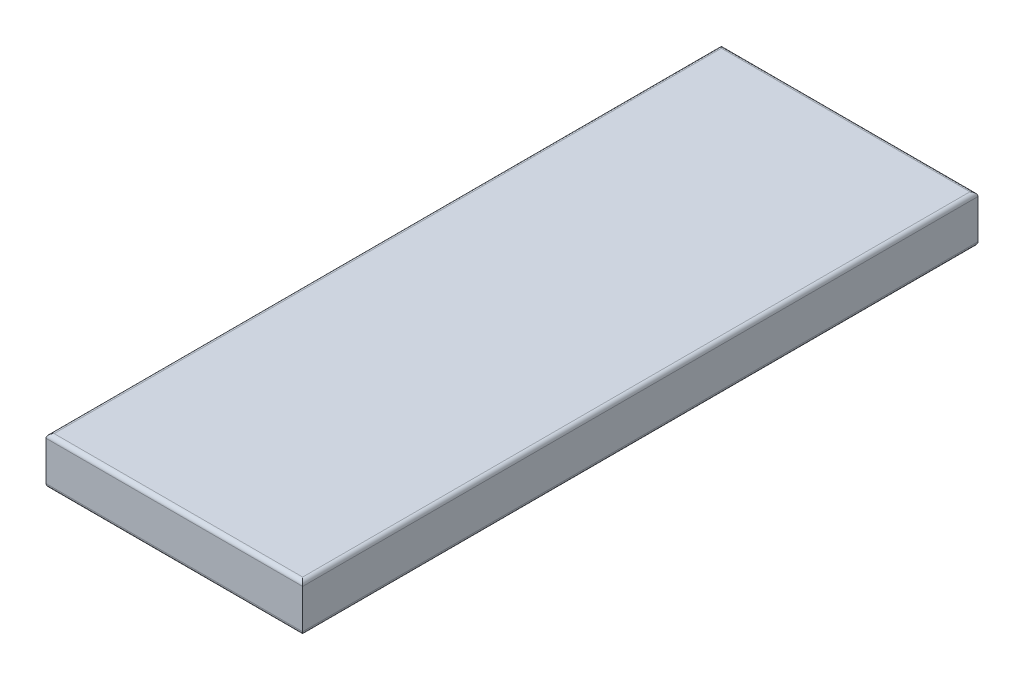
ISO-10303-21;
HEADER;
FILE_DESCRIPTION(('STEP AP214'),'2;1');
FILE_NAME('part.step','',(''),(''),'','','');
FILE_SCHEMA(('AUTOMOTIVE_DESIGN { 1 0 10303 214 1 1 1 1 }'));
ENDSEC;
DATA;
#1=APPLICATION_CONTEXT('core data for automotive mechanical design processes');
#2=APPLICATION_PROTOCOL_DEFINITION('international standard','automotive_design',2000,#1);
#3=PRODUCT_CONTEXT('',#1,'mechanical');
#4=PRODUCT('Part','Part','',(#3));
#5=PRODUCT_RELATED_PRODUCT_CATEGORY('part','',(#4));
#6=PRODUCT_DEFINITION_FORMATION('','',#4);
#7=PRODUCT_DEFINITION_CONTEXT('part definition',#1,'design');
#8=PRODUCT_DEFINITION('design','',#6,#7);
#9=PRODUCT_DEFINITION_SHAPE('','',#8);
#10=(LENGTH_UNIT() NAMED_UNIT(*) SI_UNIT(.MILLI.,.METRE.));
#11=(NAMED_UNIT(*) PLANE_ANGLE_UNIT() SI_UNIT($,.RADIAN.));
#12=(NAMED_UNIT(*) SI_UNIT($,.STERADIAN.) SOLID_ANGLE_UNIT());
#13=UNCERTAINTY_MEASURE_WITH_UNIT(LENGTH_MEASURE(1.E-05),#10,'distance_accuracy_value','');
#14=(GEOMETRIC_REPRESENTATION_CONTEXT(3) GLOBAL_UNCERTAINTY_ASSIGNED_CONTEXT((#13)) GLOBAL_UNIT_ASSIGNED_CONTEXT((#10,
#11,#12)) REPRESENTATION_CONTEXT('',''));
#15=CARTESIAN_POINT('',(0.,0.,0.));
#16=DIRECTION('',(0.,0.,1.));
#17=DIRECTION('',(1.,0.,0.));
#18=AXIS2_PLACEMENT_3D('',#15,#16,#17);
#19=CARTESIAN_POINT('',(9.5,1.75,50.));
#20=DIRECTION('',(-1.,0.,0.));
#21=DIRECTION('',(0.,0.,1.));
#22=AXIS2_PLACEMENT_3D('',#19,#20,#21);
#23=PLANE('',#22);
#24=DIRECTION('',(0.,1.,0.));
#25=VECTOR('',#24,1.);
#26=CARTESIAN_POINT('',(9.5,1.75,50.));
#27=LINE('',#26,#25);
#28=CARTESIAN_POINT('',(9.5,-1.45,50.));
#29=VERTEX_POINT('',#28);
#30=CARTESIAN_POINT('',(9.5,1.45,50.));
#31=VERTEX_POINT('',#30);
#32=EDGE_CURVE('E180',#29,#31,#27,.T.);
#33=ORIENTED_EDGE('',*,*,#32,.F.);
#34=DIRECTION('',(0.,0.,-1.));
#35=VECTOR('',#34,1.);
#36=CARTESIAN_POINT('',(9.5,-1.45,50.));
#37=LINE('',#36,#35);
#38=CARTESIAN_POINT('',(9.5,-1.45,0.));
#39=VERTEX_POINT('',#38);
#40=EDGE_CURVE('E138',#29,#39,#37,.T.);
#41=ORIENTED_EDGE('',*,*,#40,.T.);
#42=DIRECTION('',(0.,1.,0.));
#43=VECTOR('',#42,1.);
#44=CARTESIAN_POINT('',(9.5,1.75,0.));
#45=LINE('',#44,#43);
#46=CARTESIAN_POINT('',(9.5,1.45,0.));
#47=VERTEX_POINT('',#46);
#48=EDGE_CURVE('E153',#39,#47,#45,.T.);
#49=ORIENTED_EDGE('',*,*,#48,.T.);
#50=DIRECTION('',(0.,0.,-1.));
#51=VECTOR('',#50,1.);
#52=CARTESIAN_POINT('',(9.5,1.45,50.));
#53=LINE('',#52,#51);
#54=EDGE_CURVE('E135',#47,#31,#53,.F.);
#55=ORIENTED_EDGE('',*,*,#54,.T.);
#56=EDGE_LOOP('',(#33,#41,#49,#55));
#57=FACE_BOUND('',#56,.T.);
#58=ADVANCED_FACE('F33',(#57),#23,.F.);
#59=CARTESIAN_POINT('',(-9.5,1.75,50.));
#60=DIRECTION('',(0.,-1.,0.));
#61=DIRECTION('',(0.,0.,-1.));
#62=AXIS2_PLACEMENT_3D('',#59,#60,#61);
#63=PLANE('',#62);
#64=DIRECTION('',(-1.,0.,0.));
#65=VECTOR('',#64,1.);
#66=CARTESIAN_POINT('',(9.5,1.75,49.7));
#67=LINE('',#66,#65);
#68=CARTESIAN_POINT('',(-9.2,1.75,49.7));
#69=VERTEX_POINT('',#68);
#70=CARTESIAN_POINT('',(9.2,1.75,49.7));
#71=VERTEX_POINT('',#70);
#72=EDGE_CURVE('E42',#69,#71,#67,.F.);
#73=ORIENTED_EDGE('',*,*,#72,.T.);
#74=DIRECTION('',(0.,0.,-1.));
#75=VECTOR('',#74,1.);
#76=CARTESIAN_POINT('',(9.2,1.75,50.));
#77=LINE('',#76,#75);
#78=CARTESIAN_POINT('',(9.2,1.75,0.300000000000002));
#79=VERTEX_POINT('',#78);
#80=EDGE_CURVE('E11',#71,#79,#77,.T.);
#81=ORIENTED_EDGE('',*,*,#80,.T.);
#82=DIRECTION('',(-1.,0.,0.));
#83=VECTOR('',#82,1.);
#84=CARTESIAN_POINT('',(-9.5,1.75,0.300000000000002));
#85=LINE('',#84,#83);
#86=CARTESIAN_POINT('',(-9.2,1.75,0.300000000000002));
#87=VERTEX_POINT('',#86);
#88=EDGE_CURVE('E144',#79,#87,#85,.T.);
#89=ORIENTED_EDGE('',*,*,#88,.T.);
#90=DIRECTION('',(0.,0.,-1.));
#91=VECTOR('',#90,1.);
#92=CARTESIAN_POINT('',(-9.2,1.75,50.));
#93=LINE('',#92,#91);
#94=EDGE_CURVE('E53',#87,#69,#93,.F.);
#95=ORIENTED_EDGE('',*,*,#94,.T.);
#96=EDGE_LOOP('',(#73,#81,#89,#95));
#97=FACE_BOUND('',#96,.T.);
#98=ADVANCED_FACE('F203',(#97),#63,.F.);
#99=CARTESIAN_POINT('',(-9.5,1.75,50.));
#100=DIRECTION('',(1.,0.,0.));
#101=DIRECTION('',(0.,0.,-1.));
#102=AXIS2_PLACEMENT_3D('',#99,#100,#101);
#103=PLANE('',#102);
#104=DIRECTION('',(0.,-1.,0.));
#105=VECTOR('',#104,1.);
#106=CARTESIAN_POINT('',(-9.5,1.75,0.));
#107=LINE('',#106,#105);
#108=CARTESIAN_POINT('',(-9.5,1.45,0.));
#109=VERTEX_POINT('',#108);
#110=CARTESIAN_POINT('',(-9.5,-1.45,0.));
#111=VERTEX_POINT('',#110);
#112=EDGE_CURVE('E174',#109,#111,#107,.T.);
#113=ORIENTED_EDGE('',*,*,#112,.T.);
#114=DIRECTION('',(0.,0.,-1.));
#115=VECTOR('',#114,1.);
#116=CARTESIAN_POINT('',(-9.5,-1.45,50.));
#117=LINE('',#116,#115);
#118=CARTESIAN_POINT('',(-9.5,-1.45,50.));
#119=VERTEX_POINT('',#118);
#120=EDGE_CURVE('E105',#111,#119,#117,.F.);
#121=ORIENTED_EDGE('',*,*,#120,.T.);
#122=DIRECTION('',(0.,-1.,0.));
#123=VECTOR('',#122,1.);
#124=CARTESIAN_POINT('',(-9.5,1.75,50.));
#125=LINE('',#124,#123);
#126=CARTESIAN_POINT('',(-9.5,1.45,50.));
#127=VERTEX_POINT('',#126);
#128=EDGE_CURVE('E118',#127,#119,#125,.T.);
#129=ORIENTED_EDGE('',*,*,#128,.F.);
#130=DIRECTION('',(0.,0.,-1.));
#131=VECTOR('',#130,1.);
#132=CARTESIAN_POINT('',(-9.5,1.45,50.));
#133=LINE('',#132,#131);
#134=EDGE_CURVE('E124',#127,#109,#133,.T.);
#135=ORIENTED_EDGE('',*,*,#134,.T.);
#136=EDGE_LOOP('',(#113,#121,#129,#135));
#137=FACE_BOUND('',#136,.T.);
#138=ADVANCED_FACE('F173',(#137),#103,.F.);
#139=CARTESIAN_POINT('',(-9.5,-1.75,50.));
#140=DIRECTION('',(0.,1.,0.));
#141=DIRECTION('',(-1.,0.,0.));
#142=AXIS2_PLACEMENT_3D('',#139,#140,#141);
#143=PLANE('',#142);
#144=DIRECTION('',(1.,0.,0.));
#145=VECTOR('',#144,1.);
#146=CARTESIAN_POINT('',(-9.5,-1.75,49.7));
#147=LINE('',#146,#145);
#148=CARTESIAN_POINT('',(9.2,-1.75,49.7));
#149=VERTEX_POINT('',#148);
#150=CARTESIAN_POINT('',(-9.2,-1.75,49.7));
#151=VERTEX_POINT('',#150);
#152=EDGE_CURVE('E122',#149,#151,#147,.F.);
#153=ORIENTED_EDGE('',*,*,#152,.T.);
#154=DIRECTION('',(0.,0.,-1.));
#155=VECTOR('',#154,1.);
#156=CARTESIAN_POINT('',(-9.2,-1.75,50.));
#157=LINE('',#156,#155);
#158=CARTESIAN_POINT('',(-9.2,-1.75,0.300000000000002));
#159=VERTEX_POINT('',#158);
#160=EDGE_CURVE('E103',#151,#159,#157,.T.);
#161=ORIENTED_EDGE('',*,*,#160,.T.);
#162=DIRECTION('',(1.,0.,0.));
#163=VECTOR('',#162,1.);
#164=CARTESIAN_POINT('',(-9.5,-1.75,0.300000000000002));
#165=LINE('',#164,#163);
#166=CARTESIAN_POINT('',(9.2,-1.75,0.300000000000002));
#167=VERTEX_POINT('',#166);
#168=EDGE_CURVE('E111',#159,#167,#165,.T.);
#169=ORIENTED_EDGE('',*,*,#168,.T.);
#170=DIRECTION('',(0.,0.,-1.));
#171=VECTOR('',#170,1.);
#172=CARTESIAN_POINT('',(9.2,-1.75,50.));
#173=LINE('',#172,#171);
#174=EDGE_CURVE('E117',#167,#149,#173,.F.);
#175=ORIENTED_EDGE('',*,*,#174,.T.);
#176=EDGE_LOOP('',(#153,#161,#169,#175));
#177=FACE_BOUND('',#176,.T.);
#178=ADVANCED_FACE('F120',(#177),#143,.F.);
#179=CARTESIAN_POINT('',(0.,0.,50.));
#180=DIRECTION('',(0.,0.,1.));
#181=DIRECTION('',(1.,0.,0.));
#182=AXIS2_PLACEMENT_3D('',#179,#180,#181);
#183=PLANE('',#182);
#184=ORIENTED_EDGE('',*,*,#128,.T.);
#185=DIRECTION('',(1.,0.,0.));
#186=VECTOR('',#185,1.);
#187=CARTESIAN_POINT('',(9.5,-1.45,50.));
#188=LINE('',#187,#186);
#189=EDGE_CURVE('E133',#119,#29,#188,.T.);
#190=ORIENTED_EDGE('',*,*,#189,.T.);
#191=ORIENTED_EDGE('',*,*,#32,.T.);
#192=DIRECTION('',(-1.,0.,0.));
#193=VECTOR('',#192,1.);
#194=CARTESIAN_POINT('',(-9.5,1.45,50.));
#195=LINE('',#194,#193);
#196=EDGE_CURVE('E131',#31,#127,#195,.T.);
#197=ORIENTED_EDGE('',*,*,#196,.T.);
#198=EDGE_LOOP('',(#184,#190,#191,#197));
#199=FACE_BOUND('',#198,.T.);
#200=ADVANCED_FACE('F195',(#199),#183,.T.);
#201=CARTESIAN_POINT('',(0.,0.,0.));
#202=DIRECTION('',(0.,0.,1.));
#203=DIRECTION('',(1.,0.,0.));
#204=AXIS2_PLACEMENT_3D('',#201,#202,#203);
#205=PLANE('',#204);
#206=ORIENTED_EDGE('',*,*,#48,.F.);
#207=DIRECTION('',(1.,0.,0.));
#208=VECTOR('',#207,1.);
#209=CARTESIAN_POINT('',(0.,-1.45,0.));
#210=LINE('',#209,#208);
#211=EDGE_CURVE('E142',#39,#111,#210,.F.);
#212=ORIENTED_EDGE('',*,*,#211,.T.);
#213=ORIENTED_EDGE('',*,*,#112,.F.);
#214=DIRECTION('',(-1.,0.,0.));
#215=VECTOR('',#214,1.);
#216=CARTESIAN_POINT('',(0.,1.45,0.));
#217=LINE('',#216,#215);
#218=EDGE_CURVE('E140',#109,#47,#217,.F.);
#219=ORIENTED_EDGE('',*,*,#218,.T.);
#220=EDGE_LOOP('',(#206,#212,#213,#219));
#221=FACE_BOUND('',#220,.T.);
#222=ADVANCED_FACE('F178',(#221),#205,.F.);
#223=CARTESIAN_POINT('',(9.2,-1.45,50.));
#224=DIRECTION('',(0.,0.,-1.));
#225=DIRECTION('',(-1.,0.,0.));
#226=AXIS2_PLACEMENT_3D('',#223,#224,#225);
#227=CYLINDRICAL_SURFACE('',#226,0.3);
#228=CARTESIAN_POINT('',(9.2,-1.45,0.300000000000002));
#229=DIRECTION('',(0.707106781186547,0.,0.707106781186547));
#230=DIRECTION('',(0.707106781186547,0.,-0.707106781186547));
#231=AXIS2_PLACEMENT_3D('',#228,#229,#230);
#232=ELLIPSE('',#231,0.424264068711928,0.3);
#233=EDGE_CURVE('E114',#39,#167,#232,.F.);
#234=ORIENTED_EDGE('',*,*,#233,.F.);
#235=ORIENTED_EDGE('',*,*,#40,.F.);
#236=CARTESIAN_POINT('',(9.2,-1.45,49.7));
#237=DIRECTION('',(0.707106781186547,0.,-0.707106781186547));
#238=DIRECTION('',(-0.707106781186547,0.,-0.707106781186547));
#239=AXIS2_PLACEMENT_3D('',#236,#237,#238);
#240=ELLIPSE('',#239,0.424264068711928,0.3);
#241=EDGE_CURVE('E150',#149,#29,#240,.F.);
#242=ORIENTED_EDGE('',*,*,#241,.F.);
#243=ORIENTED_EDGE('',*,*,#174,.F.);
#244=EDGE_LOOP('',(#234,#235,#242,#243));
#245=FACE_BOUND('',#244,.T.);
#246=ADVANCED_FACE('F189',(#245),#227,.T.);
#247=CARTESIAN_POINT('',(0.,-1.45,49.7));
#248=DIRECTION('',(-1.,0.,0.));
#249=DIRECTION('',(0.,-1.,0.));
#250=AXIS2_PLACEMENT_3D('',#247,#248,#249);
#251=CYLINDRICAL_SURFACE('',#250,0.3);
#252=ORIENTED_EDGE('',*,*,#241,.T.);
#253=ORIENTED_EDGE('',*,*,#189,.F.);
#254=CARTESIAN_POINT('',(-9.2,-1.45,49.7));
#255=DIRECTION('',(-0.707106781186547,0.,-0.707106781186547));
#256=DIRECTION('',(-0.707106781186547,0.,0.707106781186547));
#257=AXIS2_PLACEMENT_3D('',#254,#255,#256);
#258=ELLIPSE('',#257,0.424264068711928,0.3);
#259=EDGE_CURVE('E108',#151,#119,#258,.T.);
#260=ORIENTED_EDGE('',*,*,#259,.F.);
#261=ORIENTED_EDGE('',*,*,#152,.F.);
#262=EDGE_LOOP('',(#252,#253,#260,#261));
#263=FACE_BOUND('',#262,.T.);
#264=ADVANCED_FACE('F192',(#263),#251,.T.);
#265=CARTESIAN_POINT('',(-9.5,-1.45,0.300000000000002));
#266=DIRECTION('',(1.,0.,0.));
#267=DIRECTION('',(0.,1.,0.));
#268=AXIS2_PLACEMENT_3D('',#265,#266,#267);
#269=CYLINDRICAL_SURFACE('',#268,0.3);
#270=ORIENTED_EDGE('',*,*,#233,.T.);
#271=ORIENTED_EDGE('',*,*,#168,.F.);
#272=CARTESIAN_POINT('',(-9.2,-1.45,0.300000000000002));
#273=DIRECTION('',(0.707106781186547,0.,-0.707106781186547));
#274=DIRECTION('',(0.707106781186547,0.,0.707106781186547));
#275=AXIS2_PLACEMENT_3D('',#272,#273,#274);
#276=ELLIPSE('',#275,0.424264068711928,0.3);
#277=EDGE_CURVE('E99',#111,#159,#276,.F.);
#278=ORIENTED_EDGE('',*,*,#277,.F.);
#279=ORIENTED_EDGE('',*,*,#211,.F.);
#280=EDGE_LOOP('',(#270,#271,#278,#279));
#281=FACE_BOUND('',#280,.T.);
#282=ADVANCED_FACE('F112',(#281),#269,.T.);
#283=CARTESIAN_POINT('',(-9.2,-1.45,50.));
#284=DIRECTION('',(0.,0.,-1.));
#285=DIRECTION('',(-1.,0.,0.));
#286=AXIS2_PLACEMENT_3D('',#283,#284,#285);
#287=CYLINDRICAL_SURFACE('',#286,0.3);
#288=ORIENTED_EDGE('',*,*,#259,.T.);
#289=ORIENTED_EDGE('',*,*,#120,.F.);
#290=ORIENTED_EDGE('',*,*,#277,.T.);
#291=ORIENTED_EDGE('',*,*,#160,.F.);
#292=EDGE_LOOP('',(#288,#289,#290,#291));
#293=FACE_BOUND('',#292,.T.);
#294=ADVANCED_FACE('F101',(#293),#287,.T.);
#295=CARTESIAN_POINT('',(-9.2,1.45,50.));
#296=DIRECTION('',(0.,0.,-1.));
#297=DIRECTION('',(-1.,0.,0.));
#298=AXIS2_PLACEMENT_3D('',#295,#296,#297);
#299=CYLINDRICAL_SURFACE('',#298,0.3);
#300=CARTESIAN_POINT('',(-9.2,1.45,0.300000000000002));
#301=DIRECTION('',(-0.707106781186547,0.,0.707106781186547));
#302=DIRECTION('',(-0.707106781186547,0.,-0.707106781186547));
#303=AXIS2_PLACEMENT_3D('',#300,#301,#302);
#304=ELLIPSE('',#303,0.424264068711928,0.3);
#305=EDGE_CURVE('E157',#109,#87,#304,.F.);
#306=ORIENTED_EDGE('',*,*,#305,.F.);
#307=ORIENTED_EDGE('',*,*,#134,.F.);
#308=CARTESIAN_POINT('',(-9.2,1.45,49.7));
#309=DIRECTION('',(-0.707106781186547,0.,-0.707106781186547));
#310=DIRECTION('',(0.707106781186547,0.,-0.707106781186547));
#311=AXIS2_PLACEMENT_3D('',#308,#309,#310);
#312=ELLIPSE('',#311,0.424264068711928,0.3);
#313=EDGE_CURVE('E37',#69,#127,#312,.F.);
#314=ORIENTED_EDGE('',*,*,#313,.F.);
#315=ORIENTED_EDGE('',*,*,#94,.F.);
#316=EDGE_LOOP('',(#306,#307,#314,#315));
#317=FACE_BOUND('',#316,.T.);
#318=ADVANCED_FACE('F35',(#317),#299,.T.);
#319=CARTESIAN_POINT('',(0.,1.45,49.7));
#320=DIRECTION('',(1.,0.,0.));
#321=DIRECTION('',(0.,0.,-1.));
#322=AXIS2_PLACEMENT_3D('',#319,#320,#321);
#323=CYLINDRICAL_SURFACE('',#322,0.3);
#324=ORIENTED_EDGE('',*,*,#313,.T.);
#325=ORIENTED_EDGE('',*,*,#196,.F.);
#326=CARTESIAN_POINT('',(9.2,1.45,49.7));
#327=DIRECTION('',(0.707106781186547,0.,-0.707106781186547));
#328=DIRECTION('',(0.707106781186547,0.,0.707106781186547));
#329=AXIS2_PLACEMENT_3D('',#326,#327,#328);
#330=ELLIPSE('',#329,0.424264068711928,0.3);
#331=EDGE_CURVE('E156',#71,#31,#330,.T.);
#332=ORIENTED_EDGE('',*,*,#331,.F.);
#333=ORIENTED_EDGE('',*,*,#72,.F.);
#334=EDGE_LOOP('',(#324,#325,#332,#333));
#335=FACE_BOUND('',#334,.T.);
#336=ADVANCED_FACE('F166',(#335),#323,.T.);
#337=CARTESIAN_POINT('',(-9.5,1.45,0.300000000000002));
#338=DIRECTION('',(-1.,0.,0.));
#339=DIRECTION('',(0.,0.,1.));
#340=AXIS2_PLACEMENT_3D('',#337,#338,#339);
#341=CYLINDRICAL_SURFACE('',#340,0.3);
#342=ORIENTED_EDGE('',*,*,#305,.T.);
#343=ORIENTED_EDGE('',*,*,#88,.F.);
#344=CARTESIAN_POINT('',(9.2,1.45,0.300000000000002));
#345=DIRECTION('',(-0.707106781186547,0.,-0.707106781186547));
#346=DIRECTION('',(-0.707106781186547,0.,0.707106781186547));
#347=AXIS2_PLACEMENT_3D('',#344,#345,#346);
#348=ELLIPSE('',#347,0.424264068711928,0.3);
#349=EDGE_CURVE('E154',#47,#79,#348,.F.);
#350=ORIENTED_EDGE('',*,*,#349,.F.);
#351=ORIENTED_EDGE('',*,*,#218,.F.);
#352=EDGE_LOOP('',(#342,#343,#350,#351));
#353=FACE_BOUND('',#352,.T.);
#354=ADVANCED_FACE('F202',(#353),#341,.T.);
#355=CARTESIAN_POINT('',(9.2,1.45,50.));
#356=DIRECTION('',(0.,0.,-1.));
#357=DIRECTION('',(-1.,0.,0.));
#358=AXIS2_PLACEMENT_3D('',#355,#356,#357);
#359=CYLINDRICAL_SURFACE('',#358,0.3);
#360=ORIENTED_EDGE('',*,*,#331,.T.);
#361=ORIENTED_EDGE('',*,*,#54,.F.);
#362=ORIENTED_EDGE('',*,*,#349,.T.);
#363=ORIENTED_EDGE('',*,*,#80,.F.);
#364=EDGE_LOOP('',(#360,#361,#362,#363));
#365=FACE_BOUND('',#364,.T.);
#366=ADVANCED_FACE('F200',(#365),#359,.T.);
#367=CLOSED_SHELL('',(#58,#98,#138,#178,#200,#222,#246,#264,#282,#294,#318,#336,#354,#366));
#368=MANIFOLD_SOLID_BREP('B2',#367);
#369=ADVANCED_BREP_SHAPE_REPRESENTATION('',(#18,#368),#14);
#370=SHAPE_DEFINITION_REPRESENTATION(#9,#369);
ENDSEC;
END-ISO-10303-21;
